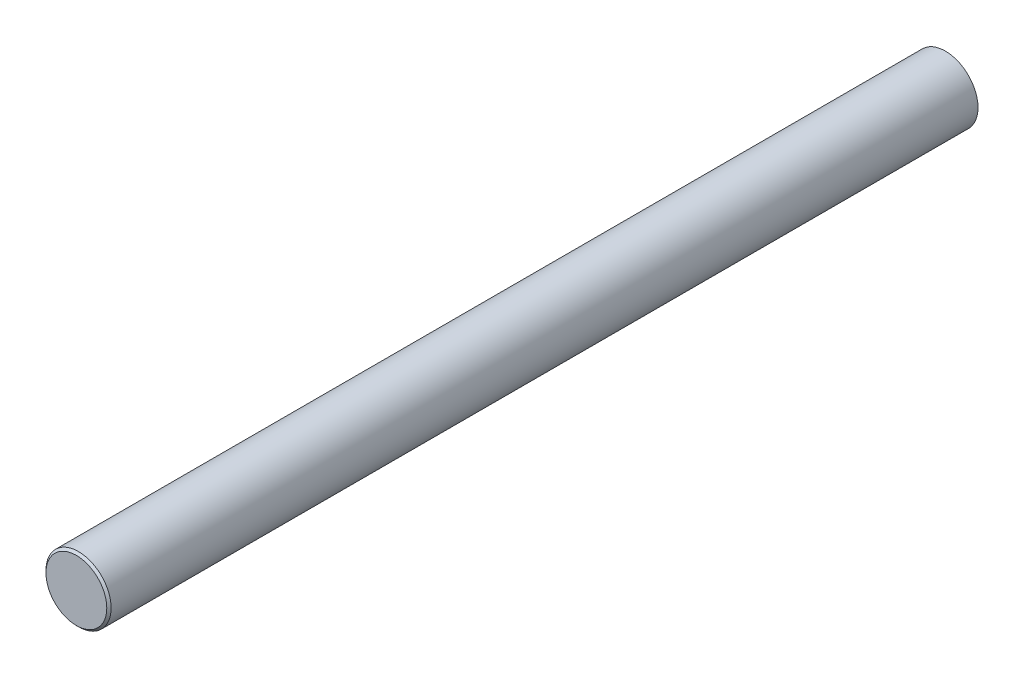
ISO-10303-21;
HEADER;
FILE_DESCRIPTION(('STEP AP214'),'2;1');
FILE_NAME('part.step','',(''),(''),'','','');
FILE_SCHEMA(('AUTOMOTIVE_DESIGN { 1 0 10303 214 1 1 1 1 }'));
ENDSEC;
DATA;
#1=APPLICATION_CONTEXT('core data for automotive mechanical design processes');
#2=APPLICATION_PROTOCOL_DEFINITION('international standard','automotive_design',2000,#1);
#3=PRODUCT_CONTEXT('',#1,'mechanical');
#4=PRODUCT('Part','Part','',(#3));
#5=PRODUCT_RELATED_PRODUCT_CATEGORY('part','',(#4));
#6=PRODUCT_DEFINITION_FORMATION('','',#4);
#7=PRODUCT_DEFINITION_CONTEXT('part definition',#1,'design');
#8=PRODUCT_DEFINITION('design','',#6,#7);
#9=PRODUCT_DEFINITION_SHAPE('','',#8);
#10=(LENGTH_UNIT() NAMED_UNIT(*) SI_UNIT(.MILLI.,.METRE.));
#11=(NAMED_UNIT(*) PLANE_ANGLE_UNIT() SI_UNIT($,.RADIAN.));
#12=(NAMED_UNIT(*) SI_UNIT($,.STERADIAN.) SOLID_ANGLE_UNIT());
#13=UNCERTAINTY_MEASURE_WITH_UNIT(LENGTH_MEASURE(1.E-05),#10,'distance_accuracy_value','');
#14=(GEOMETRIC_REPRESENTATION_CONTEXT(3) GLOBAL_UNCERTAINTY_ASSIGNED_CONTEXT((#13)) GLOBAL_UNIT_ASSIGNED_CONTEXT((#10,
#11,#12)) REPRESENTATION_CONTEXT('',''));
#15=CARTESIAN_POINT('',(0.,0.,0.));
#16=DIRECTION('',(0.,0.,1.));
#17=DIRECTION('',(1.,0.,0.));
#18=AXIS2_PLACEMENT_3D('',#15,#16,#17);
#19=CARTESIAN_POINT('',(0.,0.,400.));
#20=DIRECTION('',(0.,0.,-1.));
#21=DIRECTION('',(-1.,0.,0.));
#22=AXIS2_PLACEMENT_3D('',#19,#20,#21);
#23=CYLINDRICAL_SURFACE('',#22,15.);
#24=CARTESIAN_POINT('',(0.,0.,399.));
#25=DIRECTION('',(0.,0.,1.));
#26=DIRECTION('',(1.,0.,0.));
#27=AXIS2_PLACEMENT_3D('',#24,#25,#26);
#28=CIRCLE('',#27,15.);
#29=CARTESIAN_POINT('',(15.,0.,399.));
#30=VERTEX_POINT('',#29);
#31=EDGE_CURVE('E10',#30,#30,#28,.F.);
#32=ORIENTED_EDGE('',*,*,#31,.T.);
#33=EDGE_LOOP('',(#32));
#34=FACE_BOUND('',#33,.T.);
#35=CARTESIAN_POINT('',(0.,0.,0.));
#36=DIRECTION('',(0.,0.,1.));
#37=DIRECTION('',(1.,0.,0.));
#38=AXIS2_PLACEMENT_3D('',#35,#36,#37);
#39=CIRCLE('',#38,15.);
#40=CARTESIAN_POINT('',(15.,0.,0.));
#41=VERTEX_POINT('',#40);
#42=EDGE_CURVE('E42',#41,#41,#39,.T.);
#43=ORIENTED_EDGE('',*,*,#42,.T.);
#44=EDGE_LOOP('',(#43));
#45=FACE_BOUND('',#44,.T.);
#46=ADVANCED_FACE('F32',(#34,#45),#23,.T.);
#47=CARTESIAN_POINT('',(0.,0.,400.));
#48=DIRECTION('',(0.,0.,1.));
#49=DIRECTION('',(1.,0.,0.));
#50=AXIS2_PLACEMENT_3D('',#47,#48,#49);
#51=PLANE('',#50);
#52=CARTESIAN_POINT('',(0.,0.,400.));
#53=DIRECTION('',(0.,0.,1.));
#54=DIRECTION('',(1.,0.,0.));
#55=AXIS2_PLACEMENT_3D('',#52,#53,#54);
#56=CIRCLE('',#55,14.);
#57=CARTESIAN_POINT('',(14.,0.,400.));
#58=VERTEX_POINT('',#57);
#59=EDGE_CURVE('E38',#58,#58,#56,.T.);
#60=ORIENTED_EDGE('',*,*,#59,.T.);
#61=EDGE_LOOP('',(#60));
#62=FACE_BOUND('',#61,.T.);
#63=ADVANCED_FACE('F53',(#62),#51,.T.);
#64=CARTESIAN_POINT('',(0.,0.,0.));
#65=DIRECTION('',(0.,0.,1.));
#66=DIRECTION('',(1.,0.,0.));
#67=AXIS2_PLACEMENT_3D('',#64,#65,#66);
#68=PLANE('',#67);
#69=ORIENTED_EDGE('',*,*,#42,.F.);
#70=EDGE_LOOP('',(#69));
#71=FACE_BOUND('',#70,.T.);
#72=ADVANCED_FACE('F50',(#71),#68,.F.);
#73=CARTESIAN_POINT('',(0.,0.,400.));
#74=DIRECTION('',(0.,0.,-1.));
#75=DIRECTION('',(-1.,0.,0.));
#76=AXIS2_PLACEMENT_3D('',#73,#74,#75);
#77=CONICAL_SURFACE('',#76,14.,0.785398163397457);
#78=ORIENTED_EDGE('',*,*,#31,.F.);
#79=EDGE_LOOP('',(#78));
#80=FACE_BOUND('',#79,.T.);
#81=ORIENTED_EDGE('',*,*,#59,.F.);
#82=EDGE_LOOP('',(#81));
#83=FACE_BOUND('',#82,.T.);
#84=ADVANCED_FACE('F52',(#80,#83),#77,.T.);
#85=CLOSED_SHELL('',(#46,#63,#72,#84));
#86=MANIFOLD_SOLID_BREP('B2',#85);
#87=ADVANCED_BREP_SHAPE_REPRESENTATION('',(#18,#86),#14);
#88=SHAPE_DEFINITION_REPRESENTATION(#9,#87);
ENDSEC;
END-ISO-10303-21;
